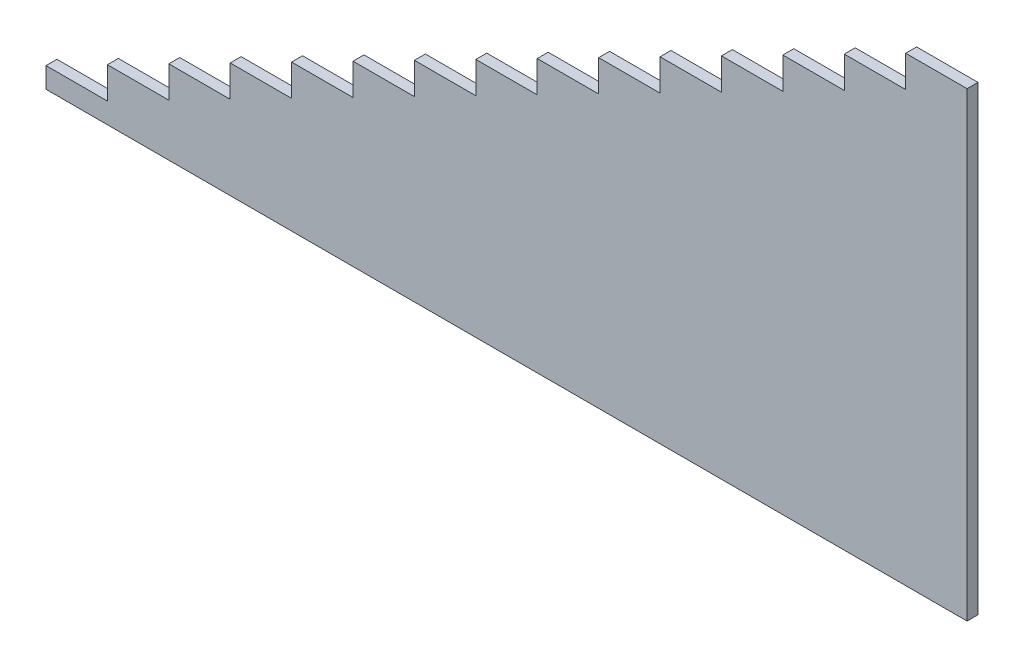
from build123d import *

# Parameters (mm, degrees)
BOSS_EXTRUDE1_DEPTH = 12.7


with BuildPart() as part:
    # Sketch1 → Boss-Extrude1 (new body)
    with BuildSketch(Plane.XY):
        Polygon((-927.862, 60.452), (-999.236, 60.452), (-999.236, 36.576), (-999.236, 23.876), (-1070.61, 23.876), (-1070.61, 0), (0, 0), (0, 535.94), (-71.374, 535.94), (-71.374, 512.064), (-71.374, 499.364), (-142.748, 499.364), (-142.748, 475.488), (-142.748, 462.788), (-214.122, 462.788), (-214.122, 438.912), (-214.122, 426.212), (-285.496, 426.212), (-285.496, 402.336), (-285.496, 389.636), (-356.87, 389.636), (-356.87, 365.76), (-356.87, 353.06), (-428.244, 353.06), (-428.244, 329.184), (-428.244, 316.484), (-499.618, 316.484), (-499.618, 292.608), (-499.618, 279.908), (-570.992, 279.908), (-570.992, 256.032), (-570.992, 243.332), (-642.366, 243.332), (-642.366, 219.456), (-642.366, 206.756), (-713.74, 206.756), (-713.74, 182.88), (-713.74, 170.18), (-785.114, 170.18), (-785.114, 146.304), (-785.114, 133.604), (-856.488, 133.604), (-856.488, 109.728), (-856.488, 97.028), (-927.862, 97.028), (-927.862, 73.152), align=None)
    extrude(amount=BOSS_EXTRUDE1_DEPTH)


solid = part.part
